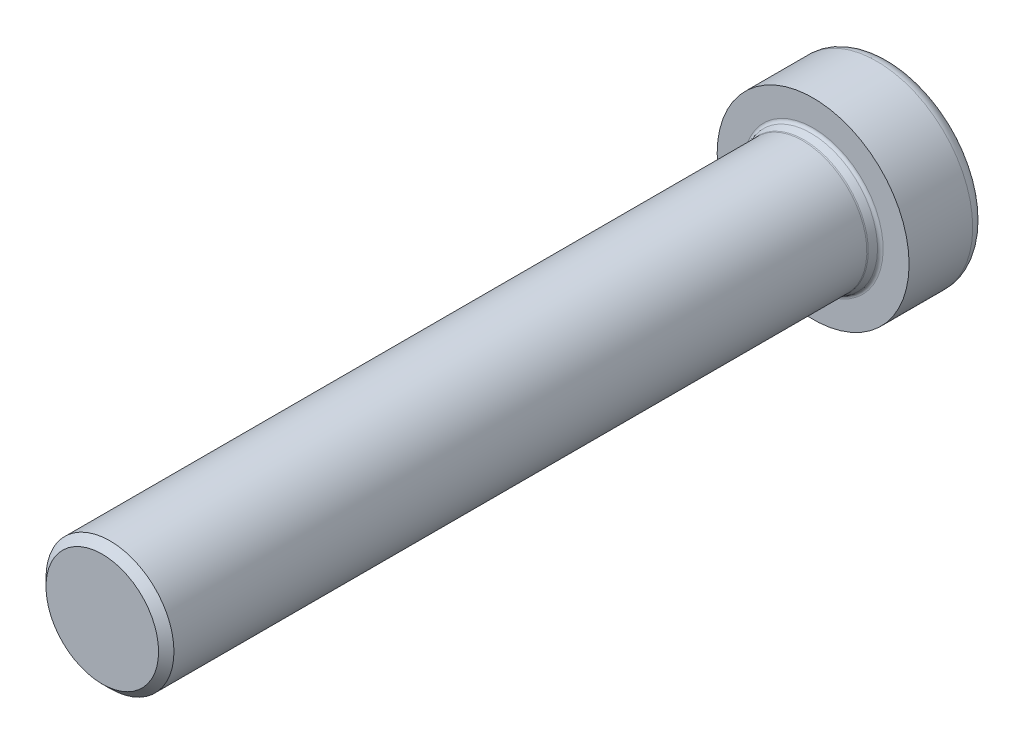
from build123d import *

# Parameters (mm, degrees)
SKIZZE1_R                       = 27
AUFSATZ_LINEAR_AUSTRAGEN1_DEPTH = 21.5
VERRUNDUNG1_R                   = 3.6
SKIZZE2_R                       = 18
AUFSATZ_LINEAR_AUSTRAGEN2_DEPTH = 200
SKIZZE4_OUTSIDE_W               = 554.394
SKIZZE4_OUTSIDE_H               = 554.394
SKIZZE4_OUTSIDE_R               = 15.835
SCHNITT_LINEAR_AUSTRAGEN1_DEPTH = 225.767101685
SCHNITT_LINEAR_AUSTRAGEN1_DRAFT = -45
SCHNITT_LINEAR_AUSTRAGEN2_DEPTH = 24


with BuildPart() as part:
    # Skizze1 → Aufsatz-Linear austragen1 (new body)
    with BuildSketch(Plane.XY):
        Circle(SKIZZE1_R)
    extrude(amount=-AUFSATZ_LINEAR_AUSTRAGEN1_DEPTH)

    # Verrundung1
    verrundung1_edges = [part.edges().sort_by_distance(p)[0] for p in [
        (-27, 0, -21.5),
    ]]
    fillet(verrundung1_edges, radius=VERRUNDUNG1_R)

    # Skizze2 → Aufsatz-Linear austragen2 (add)
    with BuildSketch(Plane.XY):
        Circle(SKIZZE2_R)
    extrude(amount=AUFSATZ_LINEAR_AUSTRAGEN2_DEPTH)

    # Skizze6 → Rotation1 (revolve)
    with BuildSketch(Plane(origin=(0, 0, 0), x_dir=(0, 0, -1), z_dir=(1, 0, 0))):
        with BuildLine():
            Line((-2.542685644, 18.062251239), (-0.652685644, 18.762251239))
            ThreePointArc((-0.652685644, 18.762251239), (-0.179233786, 19.128735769), (0, 19.7))
            Line((0, 19.7), (0, 18))
            Line((0, 18), (-2.89, 18))
            ThreePointArc((-2.89, 18), (-2.713575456, 18.015685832), (-2.542685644, 18.062251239))
        make_face()
    revolve(axis=Axis((0, 0, 0), (0, 0, 1)))


with BuildPart() as schnitt_linear_austragen1_tool:
    # Skizze4 outside → Schnitt-Linear austragen1 (with draft: the straight prism first)
    with BuildSketch(Plane.XY.offset(200)):
        Rectangle(SKIZZE4_OUTSIDE_W, SKIZZE4_OUTSIDE_H)
        Circle(SKIZZE4_OUTSIDE_R, mode=Mode.SUBTRACT)
    extrude(amount=-SCHNITT_LINEAR_AUSTRAGEN1_DEPTH)
    # Schnitt-Linear austragen1: the draft: its side faces are tilted about the plane it starts from
    schnitt_linear_austragen1_sides = [schnitt_linear_austragen1_tool.faces().sort_by_distance(p)[0] for p in [
        (0, -277.197, 87.116449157),
        (277.197, 0, 87.116449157),
        (0, 277.197, 87.116449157),
        (-277.197, 0, 87.116449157),
        (-15.835, 0, 87.116449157),
    ]]
    draft(schnitt_linear_austragen1_sides, Plane.XY.offset(200), SCHNITT_LINEAR_AUSTRAGEN1_DRAFT)


with BuildPart() as part_1:
    add(part.part)

    # Schnitt-Linear austragen1: cut by schnitt_linear_austragen1_tool
    add(schnitt_linear_austragen1_tool.part, mode=Mode.SUBTRACT)

    # Skizze3 → Schnitt-Rotation1 (revolve, cut)
    with BuildSketch(Plane(origin=(0, 0, 0), x_dir=(0, 0, -1), z_dir=(1, 0, 0))):
        Polygon((-7.696152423, 0), (-2.5, 9), (7.401923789, 9), (10, 13.5), (21.5, 13.5), (21.5, 0), align=None)
    revolve(axis=Axis((0, 0, -21.5), (0, 0, 1)), mode=Mode.SUBTRACT)

    # Skizze5 → Schnitt-Linear austragen2 (cut)
    with BuildSketch(Plane(origin=(0, 0, -21.5), x_dir=(-1, 0, 0), z_dir=(0, 0, -1))):
        with BuildLine():
            Line((15.501854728, 0.15), (7.880831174, 13.35))
            ThreePointArc((7.880831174, 13.35), (7.771023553, 13.459807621), (7.621023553, 13.5))
            Line((7.621023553, 13.5), (-7.621023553, 13.5))
            ThreePointArc((-7.621023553, 13.5), (-7.771023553, 13.459807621), (-7.880831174, 13.35))
            Line((-7.880831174, 13.35), (-15.501854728, 0.15))
            ThreePointArc((-15.501854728, 0.15), (-15.542047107, 0), (-15.501854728, -0.15))
            Line((-15.501854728, -0.15), (-7.880831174, -13.35))
            ThreePointArc((-7.880831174, -13.35), (-7.771023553, -13.459807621), (-7.621023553, -13.5))
            Line((-7.621023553, -13.5), (7.621023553, -13.5))
            ThreePointArc((7.621023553, -13.5), (7.771023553, -13.459807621), (7.880831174, -13.35))
            Line((7.880831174, -13.35), (15.501854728, -0.15))
            ThreePointArc((15.501854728, -0.15), (15.542047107, 0), (15.501854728, 0.15))
        make_face()
    extrude(amount=-SCHNITT_LINEAR_AUSTRAGEN2_DEPTH, mode=Mode.SUBTRACT)


solid = part_1.part
